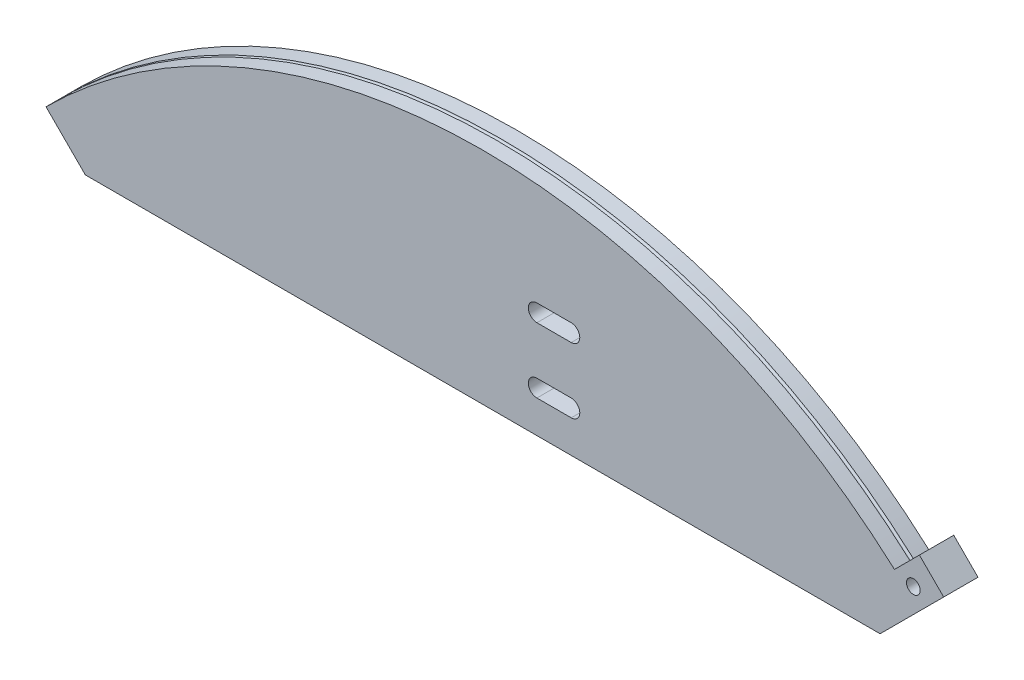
ISO-10303-21;
HEADER;
FILE_DESCRIPTION(('STEP AP214'),'2;1');
FILE_NAME('part.step','',(''),(''),'','','');
FILE_SCHEMA(('AUTOMOTIVE_DESIGN { 1 0 10303 214 1 1 1 1 }'));
ENDSEC;
DATA;
#1=APPLICATION_CONTEXT('core data for automotive mechanical design processes');
#2=APPLICATION_PROTOCOL_DEFINITION('international standard','automotive_design',2000,#1);
#3=PRODUCT_CONTEXT('',#1,'mechanical');
#4=PRODUCT('Part','Part','',(#3));
#5=PRODUCT_RELATED_PRODUCT_CATEGORY('part','',(#4));
#6=PRODUCT_DEFINITION_FORMATION('','',#4);
#7=PRODUCT_DEFINITION_CONTEXT('part definition',#1,'design');
#8=PRODUCT_DEFINITION('design','',#6,#7);
#9=PRODUCT_DEFINITION_SHAPE('','',#8);
#10=(LENGTH_UNIT() NAMED_UNIT(*) SI_UNIT(.MILLI.,.METRE.));
#11=(NAMED_UNIT(*) PLANE_ANGLE_UNIT() SI_UNIT($,.RADIAN.));
#12=(NAMED_UNIT(*) SI_UNIT($,.STERADIAN.) SOLID_ANGLE_UNIT());
#13=UNCERTAINTY_MEASURE_WITH_UNIT(LENGTH_MEASURE(1.E-05),#10,'distance_accuracy_value','');
#14=(GEOMETRIC_REPRESENTATION_CONTEXT(3) GLOBAL_UNCERTAINTY_ASSIGNED_CONTEXT((#13)) GLOBAL_UNIT_ASSIGNED_CONTEXT((#10,
#11,#12)) REPRESENTATION_CONTEXT('',''));
#15=CARTESIAN_POINT('',(0.,0.,0.));
#16=DIRECTION('',(0.,0.,1.));
#17=DIRECTION('',(1.,0.,0.));
#18=AXIS2_PLACEMENT_3D('',#15,#16,#17);
#19=CARTESIAN_POINT('',(0.,0.,5.));
#20=DIRECTION('',(0.,0.,-1.));
#21=DIRECTION('',(-1.,0.,0.));
#22=AXIS2_PLACEMENT_3D('',#19,#20,#21);
#23=CYLINDRICAL_SURFACE('',#22,180.);
#24=DIRECTION('',(0.,0.,-1.));
#25=VECTOR('',#24,1.);
#26=CARTESIAN_POINT('',(120.011582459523,134.153718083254,5.));
#27=LINE('',#26,#25);
#28=CARTESIAN_POINT('',(120.011582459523,134.153718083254,-5.));
#29=VERTEX_POINT('',#28);
#30=CARTESIAN_POINT('',(120.011582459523,134.153718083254,-0.5));
#31=VERTEX_POINT('',#30);
#32=EDGE_CURVE('E241',#29,#31,#27,.F.);
#33=ORIENTED_EDGE('',*,*,#32,.F.);
#34=CARTESIAN_POINT('',(0.,0.,-5.));
#35=DIRECTION('',(0.,0.,-1.));
#36=DIRECTION('',(-1.,0.,0.));
#37=AXIS2_PLACEMENT_3D('',#34,#35,#36);
#38=CIRCLE('',#37,180.);
#39=CARTESIAN_POINT('',(-127.279220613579,127.279220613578,-5.));
#40=VERTEX_POINT('',#39);
#41=EDGE_CURVE('E258',#40,#29,#38,.T.);
#42=ORIENTED_EDGE('',*,*,#41,.F.);
#43=DIRECTION('',(0.,0.,-1.));
#44=VECTOR('',#43,1.);
#45=CARTESIAN_POINT('',(-127.279220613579,127.279220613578,5.));
#46=LINE('',#45,#44);
#47=CARTESIAN_POINT('',(-127.279220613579,127.279220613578,-0.5));
#48=VERTEX_POINT('',#47);
#49=EDGE_CURVE('E280',#48,#40,#46,.T.);
#50=ORIENTED_EDGE('',*,*,#49,.F.);
#51=CARTESIAN_POINT('',(0.,0.,-0.5));
#52=DIRECTION('',(0.,0.,-1.));
#53=DIRECTION('',(-1.,0.,0.));
#54=AXIS2_PLACEMENT_3D('',#51,#52,#53);
#55=CIRCLE('',#54,180.);
#56=EDGE_CURVE('E249',#48,#31,#55,.T.);
#57=ORIENTED_EDGE('',*,*,#56,.T.);
#58=EDGE_LOOP('',(#33,#42,#50,#57));
#59=FACE_BOUND('',#58,.T.);
#60=ADVANCED_FACE('F32',(#59),#23,.T.);
#61=CARTESIAN_POINT('',(-120.208152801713,115.814760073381,5.));
#62=DIRECTION('',(0.,1.,0.));
#63=DIRECTION('',(0.,0.,1.));
#64=AXIS2_PLACEMENT_3D('',#61,#62,#63);
#65=PLANE('',#64);
#66=DIRECTION('',(1.,0.,0.));
#67=VECTOR('',#66,1.);
#68=CARTESIAN_POINT('',(-120.208152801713,115.814760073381,5.));
#69=LINE('',#68,#67);
#70=CARTESIAN_POINT('',(-115.814760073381,115.814760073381,5.));
#71=VERTEX_POINT('',#70);
#72=CARTESIAN_POINT('',(115.814760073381,115.814760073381,5.));
#73=VERTEX_POINT('',#72);
#74=EDGE_CURVE('E282',#71,#73,#69,.T.);
#75=ORIENTED_EDGE('',*,*,#74,.F.);
#76=DIRECTION('',(0.,0.,-1.));
#77=VECTOR('',#76,1.);
#78=CARTESIAN_POINT('',(-115.814760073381,115.814760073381,5.));
#79=LINE('',#78,#77);
#80=CARTESIAN_POINT('',(-115.814760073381,115.814760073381,0.));
#81=VERTEX_POINT('',#80);
#82=EDGE_CURVE('E209',#71,#81,#79,.T.);
#83=ORIENTED_EDGE('',*,*,#82,.T.);
#84=DIRECTION('',(1.,0.,0.));
#85=VECTOR('',#84,1.);
#86=CARTESIAN_POINT('',(-120.208152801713,115.814760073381,0.));
#87=LINE('',#86,#85);
#88=CARTESIAN_POINT('',(115.814760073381,115.814760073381,0.));
#89=VERTEX_POINT('',#88);
#90=EDGE_CURVE('E285',#81,#89,#87,.T.);
#91=ORIENTED_EDGE('',*,*,#90,.T.);
#92=DIRECTION('',(0.,0.,1.));
#93=VECTOR('',#92,1.);
#94=CARTESIAN_POINT('',(115.814760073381,115.814760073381,5.));
#95=LINE('',#94,#93);
#96=EDGE_CURVE('E214',#89,#73,#95,.T.);
#97=ORIENTED_EDGE('',*,*,#96,.T.);
#98=EDGE_LOOP('',(#75,#83,#91,#97));
#99=FACE_BOUND('',#98,.T.);
#100=ADVANCED_FACE('F34',(#99),#65,.F.);
#101=CARTESIAN_POINT('',(0.,0.,5.));
#102=DIRECTION('',(0.,0.,-1.));
#103=DIRECTION('',(-1.,0.,0.));
#104=AXIS2_PLACEMENT_3D('',#101,#102,#103);
#105=PLANE('',#104);
#106=DIRECTION('',(1.,0.,0.));
#107=VECTOR('',#106,1.);
#108=CARTESIAN_POINT('',(25.7911690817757,130.314760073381,5.));
#109=LINE('',#108,#107);
#110=CARTESIAN_POINT('',(15.7911690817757,130.314760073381,5.));
#111=VERTEX_POINT('',#110);
#112=CARTESIAN_POINT('',(25.7911690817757,130.314760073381,5.));
#113=VERTEX_POINT('',#112);
#114=EDGE_CURVE('E164',#111,#113,#109,.T.);
#115=ORIENTED_EDGE('',*,*,#114,.T.);
#116=CARTESIAN_POINT('',(25.7911690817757,127.814760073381,5.));
#117=DIRECTION('',(0.,0.,-1.));
#118=DIRECTION('',(-1.,0.,0.));
#119=AXIS2_PLACEMENT_3D('',#116,#117,#118);
#120=CIRCLE('',#119,2.5);
#121=CARTESIAN_POINT('',(25.7911690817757,125.314760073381,5.));
#122=VERTEX_POINT('',#121);
#123=EDGE_CURVE('E159',#113,#122,#120,.T.);
#124=ORIENTED_EDGE('',*,*,#123,.T.);
#125=DIRECTION('',(-1.,0.,0.));
#126=VECTOR('',#125,1.);
#127=CARTESIAN_POINT('',(25.7911690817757,125.314760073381,5.));
#128=LINE('',#127,#126);
#129=CARTESIAN_POINT('',(15.7911690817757,125.314760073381,5.));
#130=VERTEX_POINT('',#129);
#131=EDGE_CURVE('E167',#122,#130,#128,.T.);
#132=ORIENTED_EDGE('',*,*,#131,.T.);
#133=CARTESIAN_POINT('',(15.7911690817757,127.814760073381,5.));
#134=DIRECTION('',(0.,0.,-1.));
#135=DIRECTION('',(1.,0.,0.));
#136=AXIS2_PLACEMENT_3D('',#133,#134,#135);
#137=CIRCLE('',#136,2.5);
#138=EDGE_CURVE('E47',#130,#111,#137,.T.);
#139=ORIENTED_EDGE('',*,*,#138,.T.);
#140=EDGE_LOOP('',(#115,#124,#132,#139));
#141=FACE_BOUND('',#140,.T.);
#142=DIRECTION('',(-1.,0.,0.));
#143=VECTOR('',#142,1.);
#144=CARTESIAN_POINT('',(25.7911690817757,144.314760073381,5.));
#145=LINE('',#144,#143);
#146=CARTESIAN_POINT('',(25.7911690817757,144.314760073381,5.));
#147=VERTEX_POINT('',#146);
#148=CARTESIAN_POINT('',(15.7911690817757,144.314760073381,5.));
#149=VERTEX_POINT('',#148);
#150=EDGE_CURVE('E193',#147,#149,#145,.T.);
#151=ORIENTED_EDGE('',*,*,#150,.T.);
#152=CARTESIAN_POINT('',(15.7911690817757,146.814760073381,5.));
#153=DIRECTION('',(0.,0.,-1.));
#154=DIRECTION('',(-1.,0.,0.));
#155=AXIS2_PLACEMENT_3D('',#152,#153,#154);
#156=CIRCLE('',#155,2.5);
#157=CARTESIAN_POINT('',(15.7911690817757,149.314760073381,5.));
#158=VERTEX_POINT('',#157);
#159=EDGE_CURVE('E180',#149,#158,#156,.T.);
#160=ORIENTED_EDGE('',*,*,#159,.T.);
#161=DIRECTION('',(1.,0.,0.));
#162=VECTOR('',#161,1.);
#163=CARTESIAN_POINT('',(25.7911690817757,149.314760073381,5.));
#164=LINE('',#163,#162);
#165=CARTESIAN_POINT('',(25.7911690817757,149.314760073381,5.));
#166=VERTEX_POINT('',#165);
#167=EDGE_CURVE('E187',#158,#166,#164,.T.);
#168=ORIENTED_EDGE('',*,*,#167,.T.);
#169=CARTESIAN_POINT('',(25.7911690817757,146.814760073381,5.));
#170=DIRECTION('',(0.,0.,-1.));
#171=DIRECTION('',(1.,0.,0.));
#172=AXIS2_PLACEMENT_3D('',#169,#170,#171);
#173=CIRCLE('',#172,2.5);
#174=EDGE_CURVE('E190',#166,#147,#173,.T.);
#175=ORIENTED_EDGE('',*,*,#174,.T.);
#176=EDGE_LOOP('',(#151,#160,#168,#175));
#177=FACE_BOUND('',#176,.T.);
#178=DIRECTION('',(-0.707106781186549,0.707106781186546,0.));
#179=VECTOR('',#178,1.);
#180=CARTESIAN_POINT('',(-127.279220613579,127.279220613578,5.));
#181=LINE('',#180,#179);
#182=CARTESIAN_POINT('',(-127.279220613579,127.279220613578,5.));
#183=VERTEX_POINT('',#182);
#184=EDGE_CURVE('E263',#71,#183,#181,.T.);
#185=ORIENTED_EDGE('',*,*,#184,.F.);
#186=ORIENTED_EDGE('',*,*,#74,.T.);
#187=DIRECTION('',(-0.707106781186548,-0.707106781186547,0.));
#188=VECTOR('',#187,1.);
#189=CARTESIAN_POINT('',(127.279220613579,127.279220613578,5.));
#190=LINE('',#189,#188);
#191=CARTESIAN_POINT('',(134.350288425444,134.350288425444,5.));
#192=VERTEX_POINT('',#191);
#193=EDGE_CURVE('E269',#192,#73,#190,.T.);
#194=ORIENTED_EDGE('',*,*,#193,.F.);
#195=DIRECTION('',(0.707106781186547,-0.707106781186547,0.));
#196=VECTOR('',#195,1.);
#197=CARTESIAN_POINT('',(134.350288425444,134.350288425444,5.));
#198=LINE('',#197,#196);
#199=CARTESIAN_POINT('',(127.279220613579,141.421356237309,5.));
#200=VERTEX_POINT('',#199);
#201=EDGE_CURVE('E230',#200,#192,#198,.T.);
#202=ORIENTED_EDGE('',*,*,#201,.F.);
#203=DIRECTION('',(0.707106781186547,0.707106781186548,0.));
#204=VECTOR('',#203,1.);
#205=CARTESIAN_POINT('',(127.279220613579,141.421356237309,5.));
#206=LINE('',#205,#204);
#207=CARTESIAN_POINT('',(120.011582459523,134.153718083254,5.));
#208=VERTEX_POINT('',#207);
#209=EDGE_CURVE('E228',#208,#200,#206,.T.);
#210=ORIENTED_EDGE('',*,*,#209,.F.);
#211=CARTESIAN_POINT('',(0.,0.,5.));
#212=DIRECTION('',(0.,0.,-1.));
#213=DIRECTION('',(-1.,0.,0.));
#214=AXIS2_PLACEMENT_3D('',#211,#212,#213);
#215=CIRCLE('',#214,180.);
#216=EDGE_CURVE('E266',#183,#208,#215,.T.);
#217=ORIENTED_EDGE('',*,*,#216,.F.);
#218=EDGE_LOOP('',(#185,#186,#194,#202,#210,#217));
#219=FACE_BOUND('',#218,.T.);
#220=CARTESIAN_POINT('',(125.511453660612,132.582521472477,5.));
#221=DIRECTION('',(0.,0.,-1.));
#222=DIRECTION('',(-1.,0.,0.));
#223=AXIS2_PLACEMENT_3D('',#220,#221,#222);
#224=CIRCLE('',#223,2.);
#225=CARTESIAN_POINT('',(123.511453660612,132.582521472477,5.));
#226=VERTEX_POINT('',#225);
#227=EDGE_CURVE('E225',#226,#226,#224,.T.);
#228=ORIENTED_EDGE('',*,*,#227,.T.);
#229=EDGE_LOOP('',(#228));
#230=FACE_BOUND('',#229,.T.);
#231=ADVANCED_FACE('F171',(#141,#177,#219,#230),#105,.F.);
#232=CARTESIAN_POINT('',(0.,0.,0.));
#233=DIRECTION('',(0.,0.,-1.));
#234=DIRECTION('',(-1.,0.,0.));
#235=AXIS2_PLACEMENT_3D('',#232,#233,#234);
#236=PLANE('',#235);
#237=CARTESIAN_POINT('',(25.7911690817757,127.814760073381,0.));
#238=DIRECTION('',(0.,0.,-1.));
#239=DIRECTION('',(-1.,0.,0.));
#240=AXIS2_PLACEMENT_3D('',#237,#238,#239);
#241=CIRCLE('',#240,2.5);
#242=CARTESIAN_POINT('',(25.7911690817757,130.314760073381,0.));
#243=VERTEX_POINT('',#242);
#244=CARTESIAN_POINT('',(25.7911690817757,125.314760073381,0.));
#245=VERTEX_POINT('',#244);
#246=EDGE_CURVE('E11',#243,#245,#241,.T.);
#247=ORIENTED_EDGE('',*,*,#246,.F.);
#248=DIRECTION('',(1.,0.,0.));
#249=VECTOR('',#248,1.);
#250=CARTESIAN_POINT('',(0.,130.314760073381,0.));
#251=LINE('',#250,#249);
#252=CARTESIAN_POINT('',(15.7911690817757,130.314760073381,0.));
#253=VERTEX_POINT('',#252);
#254=EDGE_CURVE('E40',#253,#243,#251,.T.);
#255=ORIENTED_EDGE('',*,*,#254,.F.);
#256=CARTESIAN_POINT('',(15.7911690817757,127.814760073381,0.));
#257=DIRECTION('',(0.,0.,-1.));
#258=DIRECTION('',(-1.,0.,0.));
#259=AXIS2_PLACEMENT_3D('',#256,#257,#258);
#260=CIRCLE('',#259,2.5);
#261=CARTESIAN_POINT('',(15.7911690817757,125.314760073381,0.));
#262=VERTEX_POINT('',#261);
#263=EDGE_CURVE('E554',#262,#253,#260,.T.);
#264=ORIENTED_EDGE('',*,*,#263,.F.);
#265=DIRECTION('',(-1.,0.,0.));
#266=VECTOR('',#265,1.);
#267=CARTESIAN_POINT('',(0.,125.314760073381,0.));
#268=LINE('',#267,#266);
#269=EDGE_CURVE('E552',#245,#262,#268,.T.);
#270=ORIENTED_EDGE('',*,*,#269,.F.);
#271=EDGE_LOOP('',(#247,#255,#264,#270));
#272=FACE_BOUND('',#271,.T.);
#273=CARTESIAN_POINT('',(15.7911690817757,146.814760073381,0.));
#274=DIRECTION('',(0.,0.,-1.));
#275=DIRECTION('',(-1.,0.,0.));
#276=AXIS2_PLACEMENT_3D('',#273,#274,#275);
#277=CIRCLE('',#276,2.5);
#278=CARTESIAN_POINT('',(15.7911690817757,144.314760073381,0.));
#279=VERTEX_POINT('',#278);
#280=CARTESIAN_POINT('',(15.7911690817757,149.314760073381,0.));
#281=VERTEX_POINT('',#280);
#282=EDGE_CURVE('E549',#279,#281,#277,.T.);
#283=ORIENTED_EDGE('',*,*,#282,.F.);
#284=DIRECTION('',(-1.,0.,0.));
#285=VECTOR('',#284,1.);
#286=CARTESIAN_POINT('',(0.,144.314760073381,0.));
#287=LINE('',#286,#285);
#288=CARTESIAN_POINT('',(25.7911690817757,144.314760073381,0.));
#289=VERTEX_POINT('',#288);
#290=EDGE_CURVE('E551',#289,#279,#287,.T.);
#291=ORIENTED_EDGE('',*,*,#290,.F.);
#292=CARTESIAN_POINT('',(25.7911690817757,146.814760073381,0.));
#293=DIRECTION('',(0.,0.,-1.));
#294=DIRECTION('',(-1.,0.,0.));
#295=AXIS2_PLACEMENT_3D('',#292,#293,#294);
#296=CIRCLE('',#295,2.5);
#297=CARTESIAN_POINT('',(25.7911690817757,149.314760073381,0.));
#298=VERTEX_POINT('',#297);
#299=EDGE_CURVE('E556',#298,#289,#296,.T.);
#300=ORIENTED_EDGE('',*,*,#299,.F.);
#301=DIRECTION('',(1.,0.,0.));
#302=VECTOR('',#301,1.);
#303=CARTESIAN_POINT('',(0.,149.314760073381,0.));
#304=LINE('',#303,#302);
#305=EDGE_CURVE('E295',#281,#298,#304,.T.);
#306=ORIENTED_EDGE('',*,*,#305,.F.);
#307=EDGE_LOOP('',(#283,#291,#300,#306));
#308=FACE_BOUND('',#307,.T.);
#309=DIRECTION('',(0.707106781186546,-0.707106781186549,0.));
#310=VECTOR('',#309,1.);
#311=CARTESIAN_POINT('',(-4.51401581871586E-13,-4.51401581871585E-13,0.));
#312=LINE('',#311,#310);
#313=CARTESIAN_POINT('',(-120.208152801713,120.208152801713,0.));
#314=VERTEX_POINT('',#313);
#315=EDGE_CURVE('E200',#314,#81,#312,.T.);
#316=ORIENTED_EDGE('',*,*,#315,.F.);
#317=CARTESIAN_POINT('',(0.,0.,0.));
#318=DIRECTION('',(0.,0.,1.));
#319=DIRECTION('',(-1.,0.,0.));
#320=AXIS2_PLACEMENT_3D('',#317,#318,#319);
#321=CIRCLE('',#320,170.);
#322=CARTESIAN_POINT('',(120.208152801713,120.208152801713,0.));
#323=VERTEX_POINT('',#322);
#324=EDGE_CURVE('E276',#323,#314,#321,.T.);
#325=ORIENTED_EDGE('',*,*,#324,.F.);
#326=DIRECTION('',(0.707106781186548,0.707106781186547,0.));
#327=VECTOR('',#326,1.);
#328=CARTESIAN_POINT('',(0.,0.,0.));
#329=LINE('',#328,#327);
#330=EDGE_CURVE('E212',#89,#323,#329,.T.);
#331=ORIENTED_EDGE('',*,*,#330,.F.);
#332=ORIENTED_EDGE('',*,*,#90,.F.);
#333=EDGE_LOOP('',(#316,#325,#331,#332));
#334=FACE_BOUND('',#333,.T.);
#335=ADVANCED_FACE('F382',(#272,#308,#334),#236,.T.);
#336=CARTESIAN_POINT('',(0.,0.,5.));
#337=DIRECTION('',(0.,0.,-1.));
#338=DIRECTION('',(-1.,0.,0.));
#339=AXIS2_PLACEMENT_3D('',#336,#337,#338);
#340=CYLINDRICAL_SURFACE('',#339,170.);
#341=DIRECTION('',(0.,0.,-1.));
#342=VECTOR('',#341,1.);
#343=CARTESIAN_POINT('',(120.208152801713,120.208152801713,5.));
#344=LINE('',#343,#342);
#345=CARTESIAN_POINT('',(120.208152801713,120.208152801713,-5.));
#346=VERTEX_POINT('',#345);
#347=EDGE_CURVE('E273',#323,#346,#344,.T.);
#348=ORIENTED_EDGE('',*,*,#347,.F.);
#349=ORIENTED_EDGE('',*,*,#324,.T.);
#350=DIRECTION('',(0.,0.,-1.));
#351=VECTOR('',#350,1.);
#352=CARTESIAN_POINT('',(-120.208152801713,120.208152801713,5.));
#353=LINE('',#352,#351);
#354=CARTESIAN_POINT('',(-120.208152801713,120.208152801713,-5.));
#355=VERTEX_POINT('',#354);
#356=EDGE_CURVE('E272',#314,#355,#353,.T.);
#357=ORIENTED_EDGE('',*,*,#356,.T.);
#358=CARTESIAN_POINT('',(0.,0.,-5.));
#359=DIRECTION('',(0.,0.,1.));
#360=DIRECTION('',(-1.,0.,0.));
#361=AXIS2_PLACEMENT_3D('',#358,#359,#360);
#362=CIRCLE('',#361,170.);
#363=EDGE_CURVE('E252',#346,#355,#362,.T.);
#364=ORIENTED_EDGE('',*,*,#363,.F.);
#365=EDGE_LOOP('',(#348,#349,#357,#364));
#366=FACE_BOUND('',#365,.T.);
#367=ADVANCED_FACE('F362',(#366),#340,.F.);
#368=CARTESIAN_POINT('',(127.279220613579,127.279220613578,5.));
#369=DIRECTION('',(0.707106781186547,-0.707106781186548,0.));
#370=DIRECTION('',(0.707106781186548,0.707106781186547,0.));
#371=AXIS2_PLACEMENT_3D('',#368,#369,#370);
#372=PLANE('',#371);
#373=ORIENTED_EDGE('',*,*,#193,.T.);
#374=ORIENTED_EDGE('',*,*,#96,.F.);
#375=ORIENTED_EDGE('',*,*,#330,.T.);
#376=ORIENTED_EDGE('',*,*,#347,.T.);
#377=DIRECTION('',(-0.707106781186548,-0.707106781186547,0.));
#378=VECTOR('',#377,1.);
#379=CARTESIAN_POINT('',(127.279220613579,127.279220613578,-5.));
#380=LINE('',#379,#378);
#381=CARTESIAN_POINT('',(134.350288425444,134.350288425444,-5.));
#382=VERTEX_POINT('',#381);
#383=EDGE_CURVE('E261',#382,#346,#380,.T.);
#384=ORIENTED_EDGE('',*,*,#383,.F.);
#385=DIRECTION('',(0.,0.,-1.));
#386=VECTOR('',#385,1.);
#387=CARTESIAN_POINT('',(134.350288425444,134.350288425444,5.));
#388=LINE('',#387,#386);
#389=EDGE_CURVE('E234',#192,#382,#388,.T.);
#390=ORIENTED_EDGE('',*,*,#389,.F.);
#391=EDGE_LOOP('',(#373,#374,#375,#376,#384,#390));
#392=FACE_BOUND('',#391,.T.);
#393=ADVANCED_FACE('F354',(#392),#372,.T.);
#394=DIRECTION('',(0.,0.,-1.));
#395=VECTOR('',#394,1.);
#396=CARTESIAN_POINT('',(120.011582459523,134.153718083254,5.));
#397=LINE('',#396,#395);
#398=CARTESIAN_POINT('',(120.011582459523,134.153718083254,0.5));
#399=VERTEX_POINT('',#398);
#400=EDGE_CURVE('E237',#399,#208,#397,.F.);
#401=ORIENTED_EDGE('',*,*,#400,.F.);
#402=CARTESIAN_POINT('',(0.,0.,0.5));
#403=DIRECTION('',(0.,0.,-1.));
#404=DIRECTION('',(-1.,0.,0.));
#405=AXIS2_PLACEMENT_3D('',#402,#403,#404);
#406=CIRCLE('',#405,180.);
#407=CARTESIAN_POINT('',(-127.279220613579,127.279220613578,0.5));
#408=VERTEX_POINT('',#407);
#409=EDGE_CURVE('E246',#408,#399,#406,.T.);
#410=ORIENTED_EDGE('',*,*,#409,.F.);
#411=EDGE_CURVE('E277',#183,#408,#46,.T.);
#412=ORIENTED_EDGE('',*,*,#411,.F.);
#413=ORIENTED_EDGE('',*,*,#216,.T.);
#414=EDGE_LOOP('',(#401,#410,#412,#413));
#415=FACE_BOUND('',#414,.T.);
#416=ADVANCED_FACE('F344',(#415),#23,.T.);
#417=CARTESIAN_POINT('',(-127.279220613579,127.279220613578,5.));
#418=DIRECTION('',(-0.707106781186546,-0.707106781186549,0.));
#419=DIRECTION('',(0.707106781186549,-0.707106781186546,0.));
#420=AXIS2_PLACEMENT_3D('',#417,#418,#419);
#421=PLANE('',#420);
#422=CARTESIAN_POINT('',(-127.279220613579,127.279220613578,0.));
#423=DIRECTION('',(0.707106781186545,0.70710678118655,0.));
#424=DIRECTION('',(-0.70710678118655,0.707106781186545,0.));
#425=AXIS2_PLACEMENT_3D('',#422,#423,#424);
#426=CIRCLE('',#425,0.5);
#427=EDGE_CURVE('E243',#408,#48,#426,.T.);
#428=ORIENTED_EDGE('',*,*,#427,.T.);
#429=ORIENTED_EDGE('',*,*,#49,.T.);
#430=DIRECTION('',(-0.707106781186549,0.707106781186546,0.));
#431=VECTOR('',#430,1.);
#432=CARTESIAN_POINT('',(-127.279220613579,127.279220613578,-5.));
#433=LINE('',#432,#431);
#434=EDGE_CURVE('E255',#355,#40,#433,.T.);
#435=ORIENTED_EDGE('',*,*,#434,.F.);
#436=ORIENTED_EDGE('',*,*,#356,.F.);
#437=ORIENTED_EDGE('',*,*,#315,.T.);
#438=ORIENTED_EDGE('',*,*,#82,.F.);
#439=ORIENTED_EDGE('',*,*,#184,.T.);
#440=ORIENTED_EDGE('',*,*,#411,.T.);
#441=EDGE_LOOP('',(#428,#429,#435,#436,#437,#438,#439,#440));
#442=FACE_BOUND('',#441,.T.);
#443=ADVANCED_FACE('F353',(#442),#421,.T.);
#444=CARTESIAN_POINT('',(0.,0.,-5.));
#445=DIRECTION('',(0.,0.,-1.));
#446=DIRECTION('',(-1.,0.,0.));
#447=AXIS2_PLACEMENT_3D('',#444,#445,#446);
#448=PLANE('',#447);
#449=ORIENTED_EDGE('',*,*,#383,.T.);
#450=ORIENTED_EDGE('',*,*,#363,.T.);
#451=ORIENTED_EDGE('',*,*,#434,.T.);
#452=ORIENTED_EDGE('',*,*,#41,.T.);
#453=DIRECTION('',(0.707106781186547,0.707106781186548,0.));
#454=VECTOR('',#453,1.);
#455=CARTESIAN_POINT('',(127.279220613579,141.421356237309,-5.));
#456=LINE('',#455,#454);
#457=CARTESIAN_POINT('',(127.279220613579,141.421356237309,-5.));
#458=VERTEX_POINT('',#457);
#459=EDGE_CURVE('E220',#29,#458,#456,.T.);
#460=ORIENTED_EDGE('',*,*,#459,.T.);
#461=DIRECTION('',(0.707106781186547,-0.707106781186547,0.));
#462=VECTOR('',#461,1.);
#463=CARTESIAN_POINT('',(134.350288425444,134.350288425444,-5.));
#464=LINE('',#463,#462);
#465=EDGE_CURVE('E222',#458,#382,#464,.T.);
#466=ORIENTED_EDGE('',*,*,#465,.T.);
#467=EDGE_LOOP('',(#449,#450,#451,#452,#460,#466));
#468=FACE_BOUND('',#467,.T.);
#469=CARTESIAN_POINT('',(125.511453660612,132.582521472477,-5.));
#470=DIRECTION('',(0.,0.,-1.));
#471=DIRECTION('',(-1.,0.,0.));
#472=AXIS2_PLACEMENT_3D('',#469,#470,#471);
#473=CIRCLE('',#472,2.);
#474=CARTESIAN_POINT('',(123.511453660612,132.582521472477,-5.));
#475=VERTEX_POINT('',#474);
#476=EDGE_CURVE('E217',#475,#475,#473,.T.);
#477=ORIENTED_EDGE('',*,*,#476,.F.);
#478=EDGE_LOOP('',(#477));
#479=FACE_BOUND('',#478,.T.);
#480=ADVANCED_FACE('F360',(#468,#479),#448,.T.);
#481=CARTESIAN_POINT('',(0.,0.,0.));
#482=DIRECTION('',(0.,0.,-1.));
#483=DIRECTION('',(-1.,0.,0.));
#484=AXIS2_PLACEMENT_3D('',#481,#482,#483);
#485=TOROIDAL_SURFACE('',#484,180.,0.5);
#486=ORIENTED_EDGE('',*,*,#409,.T.);
#487=CARTESIAN_POINT('',(119.662459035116,133.804594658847,-0.0835471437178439));
#488=CARTESIAN_POINT('',(119.665781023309,133.807916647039,-0.111217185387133));
#489=CARTESIAN_POINT('',(119.67075901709,133.812894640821,-0.138510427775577));
#490=CARTESIAN_POINT('',(119.683890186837,133.826025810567,-0.191549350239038));
#491=CARTESIAN_POINT('',(119.692047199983,133.834182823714,-0.217293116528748));
#492=CARTESIAN_POINT('',(119.71129792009,133.85343354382,-0.266467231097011));
#493=CARTESIAN_POINT('',(119.722390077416,133.864525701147,-0.289898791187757));
#494=CARTESIAN_POINT('',(119.747193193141,133.889328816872,-0.333792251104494));
#495=CARTESIAN_POINT('',(119.760903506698,133.903039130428,-0.354254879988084));
#496=CARTESIAN_POINT('',(119.790570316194,133.932705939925,-0.391661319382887));
#497=CARTESIAN_POINT('',(119.806529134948,133.948664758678,-0.408601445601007));
#498=CARTESIAN_POINT('',(119.840229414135,133.982365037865,-0.43845956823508));
#499=CARTESIAN_POINT('',(119.857970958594,134.000106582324,-0.451377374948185));
#500=CARTESIAN_POINT('',(119.894760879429,134.03689650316,-0.472843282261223));
#501=CARTESIAN_POINT('',(119.913811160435,134.055946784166,-0.481384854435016));
#502=CARTESIAN_POINT('',(119.952654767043,134.094790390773,-0.493829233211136));
#503=CARTESIAN_POINT('',(119.972448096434,134.114583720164,-0.497732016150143));
#504=CARTESIAN_POINT('',(120.012238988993,134.154374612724,-0.500790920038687));
#505=CARTESIAN_POINT('',(120.032236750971,134.174372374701,-0.499941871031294));
#506=CARTESIAN_POINT('',(120.07184781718,134.21398344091,-0.493508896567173));
#507=CARTESIAN_POINT('',(120.091461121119,134.233596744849,-0.487924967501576));
#508=CARTESIAN_POINT('',(120.1297501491,134.27188577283,-0.472177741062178));
#509=CARTESIAN_POINT('',(120.148425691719,134.290561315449,-0.462013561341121));
#510=CARTESIAN_POINT('',(120.184303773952,134.326439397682,-0.437392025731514));
#511=CARTESIAN_POINT('',(120.201506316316,134.343641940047,-0.422934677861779));
#512=CARTESIAN_POINT('',(120.233935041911,134.376070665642,-0.390148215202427));
#513=CARTESIAN_POINT('',(120.24916276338,134.391298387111,-0.371822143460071));
#514=CARTESIAN_POINT('',(120.277222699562,134.419358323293,-0.331810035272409));
#515=CARTESIAN_POINT('',(120.290054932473,134.432190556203,-0.310124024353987));
#516=CARTESIAN_POINT('',(120.31294013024,134.45507575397,-0.264040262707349));
#517=CARTESIAN_POINT('',(120.322996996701,134.465132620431,-0.239646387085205));
#518=CARTESIAN_POINT('',(120.340067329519,134.48220295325,-0.188814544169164));
#519=CARTESIAN_POINT('',(120.347080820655,134.489216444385,-0.162376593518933));
#520=CARTESIAN_POINT('',(120.357855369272,134.499990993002,-0.108247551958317));
#521=CARTESIAN_POINT('',(120.361621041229,134.50375666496,-0.0805582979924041));
#522=CARTESIAN_POINT('',(120.365808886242,134.507944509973,-0.024678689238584));
#523=CARTESIAN_POINT('',(120.366231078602,134.508366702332,0.00351166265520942));
#524=CARTESIAN_POINT('',(120.363720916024,134.505856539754,0.059568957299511));
#525=CARTESIAN_POINT('',(120.36079128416,134.502926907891,0.0874361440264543));
#526=CARTESIAN_POINT('',(120.35166584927,134.493801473,0.142079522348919));
#527=CARTESIAN_POINT('',(120.345470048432,134.487605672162,0.168855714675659));
#528=CARTESIAN_POINT('',(120.32998832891,134.47212395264,0.220562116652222));
#529=CARTESIAN_POINT('',(120.320701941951,134.462837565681,0.24549204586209));
#530=CARTESIAN_POINT('',(120.299304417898,134.441440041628,0.292796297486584));
#531=CARTESIAN_POINT('',(120.287193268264,134.429328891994,0.315170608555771));
#532=CARTESIAN_POINT('',(120.260476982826,134.402612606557,0.356754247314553));
#533=CARTESIAN_POINT('',(120.245869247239,134.388004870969,0.375960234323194));
#534=CARTESIAN_POINT('',(120.214584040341,134.356719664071,0.410637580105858));
#535=CARTESIAN_POINT('',(120.197906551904,134.340042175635,0.426108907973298));
#536=CARTESIAN_POINT('',(120.162928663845,134.305064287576,0.452902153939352));
#537=CARTESIAN_POINT('',(120.144625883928,134.286761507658,0.464217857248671));
#538=CARTESIAN_POINT('',(120.106937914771,134.249073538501,0.48234942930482));
#539=CARTESIAN_POINT('',(120.087552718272,134.229688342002,0.48916526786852));
#540=CARTESIAN_POINT('',(120.048223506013,134.190359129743,0.498111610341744));
#541=CARTESIAN_POINT('',(120.028278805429,134.170414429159,0.500236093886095));
#542=CARTESIAN_POINT('',(119.988420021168,134.130555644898,0.499722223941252));
#543=CARTESIAN_POINT('',(119.968505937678,134.110641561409,0.497083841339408));
#544=CARTESIAN_POINT('',(119.929263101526,134.071398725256,0.487115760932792));
#545=CARTESIAN_POINT('',(119.909934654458,134.052070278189,0.4797836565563));
#546=CARTESIAN_POINT('',(119.872423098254,134.014558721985,0.460632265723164));
#547=CARTESIAN_POINT('',(119.854239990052,133.996375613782,0.448812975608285));
#548=CARTESIAN_POINT('',(119.819545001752,133.961680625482,0.421027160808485));
#549=CARTESIAN_POINT('',(119.80303234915,133.94516797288,0.405062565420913));
#550=CARTESIAN_POINT('',(119.772140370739,133.914275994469,0.369435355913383));
#551=CARTESIAN_POINT('',(119.757760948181,133.899896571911,0.349772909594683));
#552=CARTESIAN_POINT('',(119.731564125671,133.873699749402,0.307336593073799));
#553=CARTESIAN_POINT('',(119.719743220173,133.861878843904,0.284567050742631));
#554=CARTESIAN_POINT('',(119.698974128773,133.841109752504,0.236534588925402));
#555=CARTESIAN_POINT('',(119.690026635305,133.832162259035,0.211271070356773));
#556=CARTESIAN_POINT('',(119.675272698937,133.817408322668,0.15900474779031));
#557=CARTESIAN_POINT('',(119.669463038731,133.811598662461,0.132003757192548));
#558=CARTESIAN_POINT('',(119.661143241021,133.803278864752,0.0770269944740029));
#559=CARTESIAN_POINT('',(119.658629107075,133.800764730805,0.0490524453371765));
#560=CARTESIAN_POINT('',(119.65727213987,133.799407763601,0.003517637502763));
#561=CARTESIAN_POINT('',(119.657402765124,133.799538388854,-0.0139940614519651));
#562=CARTESIAN_POINT('',(119.658960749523,133.801096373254,-0.0489016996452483));
#563=CARTESIAN_POINT('',(119.660388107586,133.802523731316,-0.0662976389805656));
#564=CARTESIAN_POINT('',(119.662459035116,133.804594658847,-0.0835471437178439));
#565=B_SPLINE_CURVE_WITH_KNOTS('',3,(#487,#488,#489,#490,#491,#492,#493,#494,#495,#496,#497,
#498,#499,#500,#501,#502,#503,#504,#505,#506,#507,#508,#509,#510,#511,#512,#513,#514,#515,#516,
#517,#518,#519,#520,#521,#522,#523,#524,#525,#526,#527,#528,#529,#530,#531,#532,#533,#534,#535,
#536,#537,#538,#539,#540,#541,#542,#543,#544,#545,#546,#547,#548,#549,#550,#551,#552,#553,#554,
#555,#556,#557,#558,#559,#560,#561,#562,#563,#564),.UNSPECIFIED.,.T.,.F.,(4,2,2,2,2,2,2,2,2,2,2,
2,2,2,2,2,2,2,2,2,2,2,2,2,2,2,2,2,2,2,2,2,2,2,2,2,2,2,4),(0.,0.0841341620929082,
0.168370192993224,0.252561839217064,0.336732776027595,0.420991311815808,0.505253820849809,
0.589641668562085,0.674029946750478,0.758510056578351,0.842990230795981,0.927486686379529,
1.01198298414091,1.09641306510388,1.18084250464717,1.26515264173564,1.34946209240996,
1.4336515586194,1.51784053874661,1.60196117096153,1.68608174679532,1.77021507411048,
1.85434877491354,1.93857062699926,2.02279317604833,2.10714117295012,2.19148973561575,
2.27594647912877,2.36040373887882,2.44490433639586,2.52940500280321,2.61386641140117,
2.69832398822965,2.78266510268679,2.86702652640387,2.95130128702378,3.03547375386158,
3.08792303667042,3.14037227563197),.UNSPECIFIED.);
#566=EDGE_CURVE('E284',#399,#31,#565,.T.);
#567=ORIENTED_EDGE('',*,*,#566,.T.);
#568=ORIENTED_EDGE('',*,*,#56,.F.);
#569=ORIENTED_EDGE('',*,*,#427,.F.);
#570=EDGE_LOOP('',(#486,#567,#568,#569));
#571=FACE_BOUND('',#570,.T.);
#572=ADVANCED_FACE('F297',(#571),#485,.F.);
#573=CARTESIAN_POINT('',(134.350288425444,134.350288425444,5.));
#574=DIRECTION('',(0.707106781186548,0.707106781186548,0.));
#575=DIRECTION('',(-0.707106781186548,0.707106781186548,0.));
#576=AXIS2_PLACEMENT_3D('',#573,#574,#575);
#577=PLANE('',#576);
#578=ORIENTED_EDGE('',*,*,#389,.T.);
#579=ORIENTED_EDGE('',*,*,#465,.F.);
#580=DIRECTION('',(0.,0.,-1.));
#581=VECTOR('',#580,1.);
#582=CARTESIAN_POINT('',(127.279220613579,141.421356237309,5.));
#583=LINE('',#582,#581);
#584=EDGE_CURVE('E233',#200,#458,#583,.T.);
#585=ORIENTED_EDGE('',*,*,#584,.F.);
#586=ORIENTED_EDGE('',*,*,#201,.T.);
#587=EDGE_LOOP('',(#578,#579,#585,#586));
#588=FACE_BOUND('',#587,.T.);
#589=ADVANCED_FACE('F305',(#588),#577,.T.);
#590=CARTESIAN_POINT('',(127.279220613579,141.421356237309,5.));
#591=DIRECTION('',(-0.707106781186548,0.707106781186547,0.));
#592=DIRECTION('',(-0.707106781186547,-0.707106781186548,0.));
#593=AXIS2_PLACEMENT_3D('',#590,#591,#592);
#594=PLANE('',#593);
#595=ORIENTED_EDGE('',*,*,#459,.F.);
#596=ORIENTED_EDGE('',*,*,#32,.T.);
#597=ORIENTED_EDGE('',*,*,#566,.F.);
#598=ORIENTED_EDGE('',*,*,#400,.T.);
#599=ORIENTED_EDGE('',*,*,#209,.T.);
#600=ORIENTED_EDGE('',*,*,#584,.T.);
#601=EDGE_LOOP('',(#595,#596,#597,#598,#599,#600));
#602=FACE_BOUND('',#601,.T.);
#603=ADVANCED_FACE('F300',(#602),#594,.T.);
#604=CARTESIAN_POINT('',(125.511453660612,132.582521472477,5.));
#605=DIRECTION('',(0.,0.,-1.));
#606=DIRECTION('',(-1.,0.,0.));
#607=AXIS2_PLACEMENT_3D('',#604,#605,#606);
#608=CYLINDRICAL_SURFACE('',#607,2.);
#609=ORIENTED_EDGE('',*,*,#227,.F.);
#610=EDGE_LOOP('',(#609));
#611=FACE_BOUND('',#610,.T.);
#612=ORIENTED_EDGE('',*,*,#476,.T.);
#613=EDGE_LOOP('',(#612));
#614=FACE_BOUND('',#613,.T.);
#615=ADVANCED_FACE('F304',(#611,#614),#608,.F.);
#616=CARTESIAN_POINT('',(15.7911690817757,146.814760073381,5.));
#617=DIRECTION('',(0.,0.,-1.));
#618=DIRECTION('',(-1.,0.,0.));
#619=AXIS2_PLACEMENT_3D('',#616,#617,#618);
#620=CYLINDRICAL_SURFACE('',#619,2.5);
#621=ORIENTED_EDGE('',*,*,#282,.T.);
#622=DIRECTION('',(0.,0.,-1.));
#623=VECTOR('',#622,1.);
#624=CARTESIAN_POINT('',(15.7911690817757,149.314760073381,5.));
#625=LINE('',#624,#623);
#626=EDGE_CURVE('E196',#158,#281,#625,.T.);
#627=ORIENTED_EDGE('',*,*,#626,.F.);
#628=ORIENTED_EDGE('',*,*,#159,.F.);
#629=DIRECTION('',(0.,0.,-1.));
#630=VECTOR('',#629,1.);
#631=CARTESIAN_POINT('',(15.7911690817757,144.314760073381,5.));
#632=LINE('',#631,#630);
#633=EDGE_CURVE('E197',#149,#279,#632,.T.);
#634=ORIENTED_EDGE('',*,*,#633,.T.);
#635=EDGE_LOOP('',(#621,#627,#628,#634));
#636=FACE_BOUND('',#635,.T.);
#637=ADVANCED_FACE('F312',(#636),#620,.F.);
#638=CARTESIAN_POINT('',(25.7911690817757,144.314760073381,5.));
#639=DIRECTION('',(0.,-1.,0.));
#640=DIRECTION('',(0.,0.,-1.));
#641=AXIS2_PLACEMENT_3D('',#638,#639,#640);
#642=PLANE('',#641);
#643=ORIENTED_EDGE('',*,*,#290,.T.);
#644=ORIENTED_EDGE('',*,*,#633,.F.);
#645=ORIENTED_EDGE('',*,*,#150,.F.);
#646=DIRECTION('',(0.,0.,-1.));
#647=VECTOR('',#646,1.);
#648=CARTESIAN_POINT('',(25.7911690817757,144.314760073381,5.));
#649=LINE('',#648,#647);
#650=EDGE_CURVE('E201',#147,#289,#649,.T.);
#651=ORIENTED_EDGE('',*,*,#650,.T.);
#652=EDGE_LOOP('',(#643,#644,#645,#651));
#653=FACE_BOUND('',#652,.T.);
#654=ADVANCED_FACE('F316',(#653),#642,.F.);
#655=CARTESIAN_POINT('',(25.7911690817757,146.814760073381,5.));
#656=DIRECTION('',(0.,0.,-1.));
#657=DIRECTION('',(-1.,0.,0.));
#658=AXIS2_PLACEMENT_3D('',#655,#656,#657);
#659=CYLINDRICAL_SURFACE('',#658,2.5);
#660=ORIENTED_EDGE('',*,*,#299,.T.);
#661=ORIENTED_EDGE('',*,*,#650,.F.);
#662=ORIENTED_EDGE('',*,*,#174,.F.);
#663=DIRECTION('',(0.,0.,-1.));
#664=VECTOR('',#663,1.);
#665=CARTESIAN_POINT('',(25.7911690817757,149.314760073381,5.));
#666=LINE('',#665,#664);
#667=EDGE_CURVE('E204',#166,#298,#666,.T.);
#668=ORIENTED_EDGE('',*,*,#667,.T.);
#669=EDGE_LOOP('',(#660,#661,#662,#668));
#670=FACE_BOUND('',#669,.T.);
#671=ADVANCED_FACE('F321',(#670),#659,.F.);
#672=CARTESIAN_POINT('',(25.7911690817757,149.314760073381,5.));
#673=DIRECTION('',(0.,1.,0.));
#674=DIRECTION('',(0.,0.,1.));
#675=AXIS2_PLACEMENT_3D('',#672,#673,#674);
#676=PLANE('',#675);
#677=ORIENTED_EDGE('',*,*,#305,.T.);
#678=ORIENTED_EDGE('',*,*,#667,.F.);
#679=ORIENTED_EDGE('',*,*,#167,.F.);
#680=ORIENTED_EDGE('',*,*,#626,.T.);
#681=EDGE_LOOP('',(#677,#678,#679,#680));
#682=FACE_BOUND('',#681,.T.);
#683=ADVANCED_FACE('F318',(#682),#676,.F.);
#684=CARTESIAN_POINT('',(25.7911690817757,127.814760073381,5.));
#685=DIRECTION('',(0.,0.,-1.));
#686=DIRECTION('',(-1.,0.,0.));
#687=AXIS2_PLACEMENT_3D('',#684,#685,#686);
#688=CYLINDRICAL_SURFACE('',#687,2.5);
#689=ORIENTED_EDGE('',*,*,#246,.T.);
#690=DIRECTION('',(0.,0.,-1.));
#691=VECTOR('',#690,1.);
#692=CARTESIAN_POINT('',(25.7911690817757,125.314760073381,5.));
#693=LINE('',#692,#691);
#694=EDGE_CURVE('E55',#122,#245,#693,.T.);
#695=ORIENTED_EDGE('',*,*,#694,.F.);
#696=ORIENTED_EDGE('',*,*,#123,.F.);
#697=DIRECTION('',(0.,0.,-1.));
#698=VECTOR('',#697,1.);
#699=CARTESIAN_POINT('',(25.7911690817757,130.314760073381,5.));
#700=LINE('',#699,#698);
#701=EDGE_CURVE('E178',#113,#243,#700,.T.);
#702=ORIENTED_EDGE('',*,*,#701,.T.);
#703=EDGE_LOOP('',(#689,#695,#696,#702));
#704=FACE_BOUND('',#703,.T.);
#705=ADVANCED_FACE('F156',(#704),#688,.F.);
#706=CARTESIAN_POINT('',(25.7911690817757,130.314760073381,5.));
#707=DIRECTION('',(0.,1.,0.));
#708=DIRECTION('',(0.,0.,1.));
#709=AXIS2_PLACEMENT_3D('',#706,#707,#708);
#710=PLANE('',#709);
#711=ORIENTED_EDGE('',*,*,#254,.T.);
#712=ORIENTED_EDGE('',*,*,#701,.F.);
#713=ORIENTED_EDGE('',*,*,#114,.F.);
#714=DIRECTION('',(0.,0.,-1.));
#715=VECTOR('',#714,1.);
#716=CARTESIAN_POINT('',(15.7911690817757,130.314760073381,5.));
#717=LINE('',#716,#715);
#718=EDGE_CURVE('E181',#111,#253,#717,.T.);
#719=ORIENTED_EDGE('',*,*,#718,.T.);
#720=EDGE_LOOP('',(#711,#712,#713,#719));
#721=FACE_BOUND('',#720,.T.);
#722=ADVANCED_FACE('F331',(#721),#710,.F.);
#723=CARTESIAN_POINT('',(15.7911690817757,127.814760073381,5.));
#724=DIRECTION('',(0.,0.,-1.));
#725=DIRECTION('',(-1.,0.,0.));
#726=AXIS2_PLACEMENT_3D('',#723,#724,#725);
#727=CYLINDRICAL_SURFACE('',#726,2.5);
#728=ORIENTED_EDGE('',*,*,#263,.T.);
#729=ORIENTED_EDGE('',*,*,#718,.F.);
#730=ORIENTED_EDGE('',*,*,#138,.F.);
#731=DIRECTION('',(0.,0.,-1.));
#732=VECTOR('',#731,1.);
#733=CARTESIAN_POINT('',(15.7911690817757,125.314760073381,5.));
#734=LINE('',#733,#732);
#735=EDGE_CURVE('E163',#130,#262,#734,.T.);
#736=ORIENTED_EDGE('',*,*,#735,.T.);
#737=EDGE_LOOP('',(#728,#729,#730,#736));
#738=FACE_BOUND('',#737,.T.);
#739=ADVANCED_FACE('F334',(#738),#727,.F.);
#740=CARTESIAN_POINT('',(25.7911690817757,125.314760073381,5.));
#741=DIRECTION('',(0.,-1.,0.));
#742=DIRECTION('',(0.,0.,-1.));
#743=AXIS2_PLACEMENT_3D('',#740,#741,#742);
#744=PLANE('',#743);
#745=ORIENTED_EDGE('',*,*,#269,.T.);
#746=ORIENTED_EDGE('',*,*,#735,.F.);
#747=ORIENTED_EDGE('',*,*,#131,.F.);
#748=ORIENTED_EDGE('',*,*,#694,.T.);
#749=EDGE_LOOP('',(#745,#746,#747,#748));
#750=FACE_BOUND('',#749,.T.);
#751=ADVANCED_FACE('F168',(#750),#744,.F.);
#752=CLOSED_SHELL('',(#60,#100,#231,#335,#367,#393,#416,#443,#480,#572,#589,#603,#615,#637,#654,
#671,#683,#705,#722,#739,#751));
#753=MANIFOLD_SOLID_BREP('B2',#752);
#754=ADVANCED_BREP_SHAPE_REPRESENTATION('',(#18,#753),#14);
#755=SHAPE_DEFINITION_REPRESENTATION(#9,#754);
ENDSEC;
END-ISO-10303-21;
